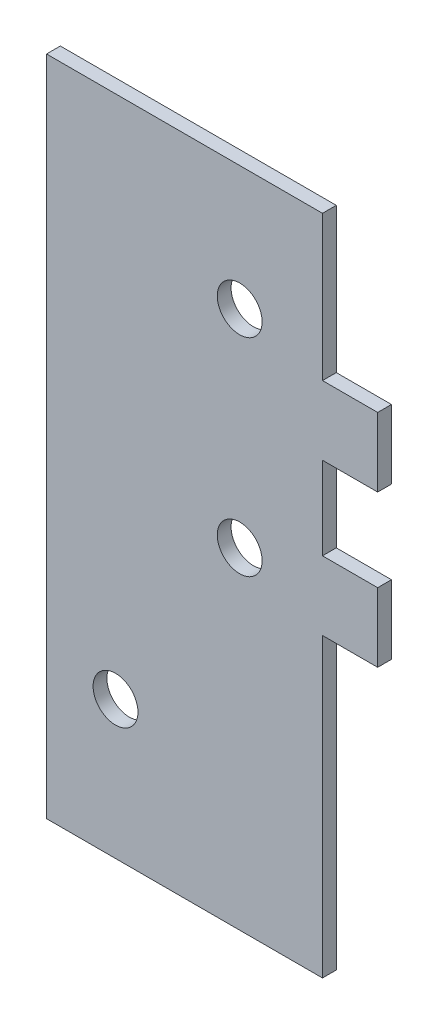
ISO-10303-21;
HEADER;
FILE_DESCRIPTION(('STEP AP214'),'2;1');
FILE_NAME('part.step','',(''),(''),'','','');
FILE_SCHEMA(('AUTOMOTIVE_DESIGN { 1 0 10303 214 1 1 1 1 }'));
ENDSEC;
DATA;
#1=APPLICATION_CONTEXT('core data for automotive mechanical design processes');
#2=APPLICATION_PROTOCOL_DEFINITION('international standard','automotive_design',2000,#1);
#3=PRODUCT_CONTEXT('',#1,'mechanical');
#4=PRODUCT('Part','Part','',(#3));
#5=PRODUCT_RELATED_PRODUCT_CATEGORY('part','',(#4));
#6=PRODUCT_DEFINITION_FORMATION('','',#4);
#7=PRODUCT_DEFINITION_CONTEXT('part definition',#1,'design');
#8=PRODUCT_DEFINITION('design','',#6,#7);
#9=PRODUCT_DEFINITION_SHAPE('','',#8);
#10=(LENGTH_UNIT() NAMED_UNIT(*) SI_UNIT(.MILLI.,.METRE.));
#11=(NAMED_UNIT(*) PLANE_ANGLE_UNIT() SI_UNIT($,.RADIAN.));
#12=(NAMED_UNIT(*) SI_UNIT($,.STERADIAN.) SOLID_ANGLE_UNIT());
#13=UNCERTAINTY_MEASURE_WITH_UNIT(LENGTH_MEASURE(1.E-05),#10,'distance_accuracy_value','');
#14=(GEOMETRIC_REPRESENTATION_CONTEXT(3) GLOBAL_UNCERTAINTY_ASSIGNED_CONTEXT((#13)) GLOBAL_UNIT_ASSIGNED_CONTEXT((#10,
#11,#12)) REPRESENTATION_CONTEXT('',''));
#15=CARTESIAN_POINT('',(0.,0.,0.));
#16=DIRECTION('',(0.,0.,1.));
#17=DIRECTION('',(1.,0.,0.));
#18=AXIS2_PLACEMENT_3D('',#15,#16,#17);
#19=CARTESIAN_POINT('',(0.,0.,6.35));
#20=DIRECTION('',(0.,0.,1.));
#21=DIRECTION('',(1.,0.,0.));
#22=AXIS2_PLACEMENT_3D('',#19,#20,#21);
#23=PLANE('',#22);
#24=CARTESIAN_POINT('',(88.9,152.4,6.35));
#25=DIRECTION('',(0.,0.,1.));
#26=DIRECTION('',(1.,0.,0.));
#27=AXIS2_PLACEMENT_3D('',#24,#25,#26);
#28=CIRCLE('',#27,10.31875);
#29=CARTESIAN_POINT('',(99.21875,152.4,6.35));
#30=VERTEX_POINT('',#29);
#31=EDGE_CURVE('E285',#30,#30,#28,.T.);
#32=ORIENTED_EDGE('',*,*,#31,.F.);
#33=EDGE_LOOP('',(#32));
#34=FACE_BOUND('',#33,.T.);
#35=DIRECTION('',(0.,-1.,0.));
#36=VECTOR('',#35,1.);
#37=CARTESIAN_POINT('',(0.,304.8,6.35));
#38=LINE('',#37,#36);
#39=CARTESIAN_POINT('',(0.,304.8,6.35));
#40=VERTEX_POINT('',#39);
#41=CARTESIAN_POINT('',(0.,0.,6.35));
#42=VERTEX_POINT('',#41);
#43=EDGE_CURVE('E176',#40,#42,#38,.T.);
#44=ORIENTED_EDGE('',*,*,#43,.T.);
#45=DIRECTION('',(1.,0.,0.));
#46=VECTOR('',#45,1.);
#47=CARTESIAN_POINT('',(0.,0.,6.35));
#48=LINE('',#47,#46);
#49=CARTESIAN_POINT('',(127.,0.,6.35));
#50=VERTEX_POINT('',#49);
#51=EDGE_CURVE('E104',#42,#50,#48,.T.);
#52=ORIENTED_EDGE('',*,*,#51,.T.);
#53=DIRECTION('',(0.,1.,0.));
#54=VECTOR('',#53,1.);
#55=CARTESIAN_POINT('',(127.,0.,6.35));
#56=LINE('',#55,#54);
#57=CARTESIAN_POINT('',(127.,136.525,6.35));
#58=VERTEX_POINT('',#57);
#59=EDGE_CURVE('E203',#50,#58,#56,.T.);
#60=ORIENTED_EDGE('',*,*,#59,.T.);
#61=DIRECTION('',(1.,0.,0.));
#62=VECTOR('',#61,1.);
#63=CARTESIAN_POINT('',(127.,136.525,6.35));
#64=LINE('',#63,#62);
#65=CARTESIAN_POINT('',(152.4,136.525,6.35));
#66=VERTEX_POINT('',#65);
#67=EDGE_CURVE('E222',#58,#66,#64,.T.);
#68=ORIENTED_EDGE('',*,*,#67,.T.);
#69=DIRECTION('',(0.,1.,0.));
#70=VECTOR('',#69,1.);
#71=CARTESIAN_POINT('',(152.4,136.525,6.35));
#72=LINE('',#71,#70);
#73=CARTESIAN_POINT('',(152.4,168.275,6.35));
#74=VERTEX_POINT('',#73);
#75=EDGE_CURVE('E219',#66,#74,#72,.T.);
#76=ORIENTED_EDGE('',*,*,#75,.T.);
#77=DIRECTION('',(-1.,0.,0.));
#78=VECTOR('',#77,1.);
#79=CARTESIAN_POINT('',(152.4,168.275,6.35));
#80=LINE('',#79,#78);
#81=CARTESIAN_POINT('',(127.,168.275,6.35));
#82=VERTEX_POINT('',#81);
#83=EDGE_CURVE('E221',#74,#82,#80,.T.);
#84=ORIENTED_EDGE('',*,*,#83,.T.);
#85=DIRECTION('',(0.,1.,0.));
#86=VECTOR('',#85,1.);
#87=CARTESIAN_POINT('',(127.,168.275,6.35));
#88=LINE('',#87,#86);
#89=CARTESIAN_POINT('',(127.,206.375,6.35));
#90=VERTEX_POINT('',#89);
#91=EDGE_CURVE('E224',#82,#90,#88,.T.);
#92=ORIENTED_EDGE('',*,*,#91,.T.);
#93=DIRECTION('',(1.,0.,0.));
#94=VECTOR('',#93,1.);
#95=CARTESIAN_POINT('',(127.,206.375,6.35));
#96=LINE('',#95,#94);
#97=CARTESIAN_POINT('',(152.4,206.375,6.35));
#98=VERTEX_POINT('',#97);
#99=EDGE_CURVE('E230',#90,#98,#96,.T.);
#100=ORIENTED_EDGE('',*,*,#99,.T.);
#101=DIRECTION('',(0.,1.,0.));
#102=VECTOR('',#101,1.);
#103=CARTESIAN_POINT('',(152.4,206.375,6.35));
#104=LINE('',#103,#102);
#105=CARTESIAN_POINT('',(152.4,238.125,6.35));
#106=VERTEX_POINT('',#105);
#107=EDGE_CURVE('E135',#98,#106,#104,.T.);
#108=ORIENTED_EDGE('',*,*,#107,.T.);
#109=DIRECTION('',(-1.,0.,0.));
#110=VECTOR('',#109,1.);
#111=CARTESIAN_POINT('',(152.4,238.125,6.35));
#112=LINE('',#111,#110);
#113=CARTESIAN_POINT('',(127.,238.125,6.35));
#114=VERTEX_POINT('',#113);
#115=EDGE_CURVE('E129',#106,#114,#112,.T.);
#116=ORIENTED_EDGE('',*,*,#115,.T.);
#117=DIRECTION('',(0.,1.,0.));
#118=VECTOR('',#117,1.);
#119=CARTESIAN_POINT('',(127.,238.125,6.35));
#120=LINE('',#119,#118);
#121=CARTESIAN_POINT('',(127.,304.8,6.35));
#122=VERTEX_POINT('',#121);
#123=EDGE_CURVE('E133',#114,#122,#120,.T.);
#124=ORIENTED_EDGE('',*,*,#123,.T.);
#125=DIRECTION('',(-1.,0.,0.));
#126=VECTOR('',#125,1.);
#127=CARTESIAN_POINT('',(127.,304.8,6.35));
#128=LINE('',#127,#126);
#129=EDGE_CURVE('E49',#122,#40,#128,.T.);
#130=ORIENTED_EDGE('',*,*,#129,.T.);
#131=EDGE_LOOP('',(#44,#52,#60,#68,#76,#84,#92,#100,#108,#116,#124,#130));
#132=FACE_BOUND('',#131,.T.);
#133=CARTESIAN_POINT('',(88.9,247.65,6.35));
#134=DIRECTION('',(0.,0.,1.));
#135=DIRECTION('',(1.,0.,0.));
#136=AXIS2_PLACEMENT_3D('',#133,#134,#135);
#137=CIRCLE('',#136,10.31875);
#138=CARTESIAN_POINT('',(99.21875,247.65,6.35));
#139=VERTEX_POINT('',#138);
#140=EDGE_CURVE('E157',#139,#139,#137,.T.);
#141=ORIENTED_EDGE('',*,*,#140,.F.);
#142=EDGE_LOOP('',(#141));
#143=FACE_BOUND('',#142,.T.);
#144=CARTESIAN_POINT('',(31.75,63.5,6.35));
#145=DIRECTION('',(0.,0.,1.));
#146=DIRECTION('',(1.,0.,0.));
#147=AXIS2_PLACEMENT_3D('',#144,#145,#146);
#148=CIRCLE('',#147,10.31875);
#149=CARTESIAN_POINT('',(42.06875,63.5,6.35));
#150=VERTEX_POINT('',#149);
#151=EDGE_CURVE('E276',#150,#150,#148,.T.);
#152=ORIENTED_EDGE('',*,*,#151,.F.);
#153=EDGE_LOOP('',(#152));
#154=FACE_BOUND('',#153,.T.);
#155=ADVANCED_FACE('F32',(#34,#132,#143,#154),#23,.T.);
#156=CARTESIAN_POINT('',(0.,0.,0.));
#157=DIRECTION('',(0.,0.,1.));
#158=DIRECTION('',(1.,0.,0.));
#159=AXIS2_PLACEMENT_3D('',#156,#157,#158);
#160=PLANE('',#159);
#161=DIRECTION('',(0.,-1.,0.));
#162=VECTOR('',#161,1.);
#163=CARTESIAN_POINT('',(0.,304.8,0.));
#164=LINE('',#163,#162);
#165=CARTESIAN_POINT('',(0.,304.8,0.));
#166=VERTEX_POINT('',#165);
#167=CARTESIAN_POINT('',(0.,0.,0.));
#168=VERTEX_POINT('',#167);
#169=EDGE_CURVE('E153',#166,#168,#164,.T.);
#170=ORIENTED_EDGE('',*,*,#169,.F.);
#171=DIRECTION('',(-1.,0.,0.));
#172=VECTOR('',#171,1.);
#173=CARTESIAN_POINT('',(127.,304.8,0.));
#174=LINE('',#173,#172);
#175=CARTESIAN_POINT('',(127.,304.8,0.));
#176=VERTEX_POINT('',#175);
#177=EDGE_CURVE('E96',#176,#166,#174,.T.);
#178=ORIENTED_EDGE('',*,*,#177,.F.);
#179=DIRECTION('',(0.,1.,0.));
#180=VECTOR('',#179,1.);
#181=CARTESIAN_POINT('',(127.,238.125,0.));
#182=LINE('',#181,#180);
#183=CARTESIAN_POINT('',(127.,238.125,0.));
#184=VERTEX_POINT('',#183);
#185=EDGE_CURVE('E90',#184,#176,#182,.T.);
#186=ORIENTED_EDGE('',*,*,#185,.F.);
#187=DIRECTION('',(-1.,0.,0.));
#188=VECTOR('',#187,1.);
#189=CARTESIAN_POINT('',(152.4,238.125,0.));
#190=LINE('',#189,#188);
#191=CARTESIAN_POINT('',(152.4,238.125,0.));
#192=VERTEX_POINT('',#191);
#193=EDGE_CURVE('E143',#192,#184,#190,.T.);
#194=ORIENTED_EDGE('',*,*,#193,.F.);
#195=DIRECTION('',(0.,1.,0.));
#196=VECTOR('',#195,1.);
#197=CARTESIAN_POINT('',(152.4,206.375,0.));
#198=LINE('',#197,#196);
#199=CARTESIAN_POINT('',(152.4,206.375,0.));
#200=VERTEX_POINT('',#199);
#201=EDGE_CURVE('E171',#200,#192,#198,.T.);
#202=ORIENTED_EDGE('',*,*,#201,.F.);
#203=DIRECTION('',(1.,0.,0.));
#204=VECTOR('',#203,1.);
#205=CARTESIAN_POINT('',(127.,206.375,0.));
#206=LINE('',#205,#204);
#207=CARTESIAN_POINT('',(127.,206.375,0.));
#208=VERTEX_POINT('',#207);
#209=EDGE_CURVE('E169',#208,#200,#206,.T.);
#210=ORIENTED_EDGE('',*,*,#209,.F.);
#211=DIRECTION('',(0.,1.,0.));
#212=VECTOR('',#211,1.);
#213=CARTESIAN_POINT('',(127.,168.275,0.));
#214=LINE('',#213,#212);
#215=CARTESIAN_POINT('',(127.,168.275,0.));
#216=VERTEX_POINT('',#215);
#217=EDGE_CURVE('E167',#216,#208,#214,.T.);
#218=ORIENTED_EDGE('',*,*,#217,.F.);
#219=DIRECTION('',(-1.,0.,0.));
#220=VECTOR('',#219,1.);
#221=CARTESIAN_POINT('',(152.4,168.275,0.));
#222=LINE('',#221,#220);
#223=CARTESIAN_POINT('',(152.4,168.275,0.));
#224=VERTEX_POINT('',#223);
#225=EDGE_CURVE('E165',#224,#216,#222,.T.);
#226=ORIENTED_EDGE('',*,*,#225,.F.);
#227=DIRECTION('',(0.,1.,0.));
#228=VECTOR('',#227,1.);
#229=CARTESIAN_POINT('',(152.4,136.525,0.));
#230=LINE('',#229,#228);
#231=CARTESIAN_POINT('',(152.4,136.525,0.));
#232=VERTEX_POINT('',#231);
#233=EDGE_CURVE('E163',#232,#224,#230,.T.);
#234=ORIENTED_EDGE('',*,*,#233,.F.);
#235=DIRECTION('',(1.,0.,0.));
#236=VECTOR('',#235,1.);
#237=CARTESIAN_POINT('',(127.,136.525,0.));
#238=LINE('',#237,#236);
#239=CARTESIAN_POINT('',(127.,136.525,0.));
#240=VERTEX_POINT('',#239);
#241=EDGE_CURVE('E161',#240,#232,#238,.T.);
#242=ORIENTED_EDGE('',*,*,#241,.F.);
#243=DIRECTION('',(0.,1.,0.));
#244=VECTOR('',#243,1.);
#245=CARTESIAN_POINT('',(127.,0.,0.));
#246=LINE('',#245,#244);
#247=CARTESIAN_POINT('',(127.,0.,0.));
#248=VERTEX_POINT('',#247);
#249=EDGE_CURVE('E159',#248,#240,#246,.T.);
#250=ORIENTED_EDGE('',*,*,#249,.F.);
#251=DIRECTION('',(1.,0.,0.));
#252=VECTOR('',#251,1.);
#253=CARTESIAN_POINT('',(0.,0.,0.));
#254=LINE('',#253,#252);
#255=EDGE_CURVE('E156',#168,#248,#254,.T.);
#256=ORIENTED_EDGE('',*,*,#255,.F.);
#257=EDGE_LOOP('',(#170,#178,#186,#194,#202,#210,#218,#226,#234,#242,#250,#256));
#258=FACE_BOUND('',#257,.T.);
#259=CARTESIAN_POINT('',(88.9,247.65,0.));
#260=DIRECTION('',(0.,0.,1.));
#261=DIRECTION('',(1.,0.,0.));
#262=AXIS2_PLACEMENT_3D('',#259,#260,#261);
#263=CIRCLE('',#262,10.31875);
#264=CARTESIAN_POINT('',(99.21875,247.65,0.));
#265=VERTEX_POINT('',#264);
#266=EDGE_CURVE('E288',#265,#265,#263,.T.);
#267=ORIENTED_EDGE('',*,*,#266,.T.);
#268=EDGE_LOOP('',(#267));
#269=FACE_BOUND('',#268,.T.);
#270=CARTESIAN_POINT('',(88.9,152.4,0.));
#271=DIRECTION('',(0.,0.,1.));
#272=DIRECTION('',(1.,0.,0.));
#273=AXIS2_PLACEMENT_3D('',#270,#271,#272);
#274=CIRCLE('',#273,10.31875);
#275=CARTESIAN_POINT('',(99.21875,152.4,0.));
#276=VERTEX_POINT('',#275);
#277=EDGE_CURVE('E282',#276,#276,#274,.T.);
#278=ORIENTED_EDGE('',*,*,#277,.T.);
#279=EDGE_LOOP('',(#278));
#280=FACE_BOUND('',#279,.T.);
#281=CARTESIAN_POINT('',(31.75,63.5,0.));
#282=DIRECTION('',(0.,0.,1.));
#283=DIRECTION('',(1.,0.,0.));
#284=AXIS2_PLACEMENT_3D('',#281,#282,#283);
#285=CIRCLE('',#284,10.31875);
#286=CARTESIAN_POINT('',(42.06875,63.5,0.));
#287=VERTEX_POINT('',#286);
#288=EDGE_CURVE('E279',#287,#287,#285,.T.);
#289=ORIENTED_EDGE('',*,*,#288,.T.);
#290=EDGE_LOOP('',(#289));
#291=FACE_BOUND('',#290,.T.);
#292=ADVANCED_FACE('F207',(#258,#269,#280,#291),#160,.F.);
#293=CARTESIAN_POINT('',(0.,304.8,6.35));
#294=DIRECTION('',(1.,0.,0.));
#295=DIRECTION('',(0.,1.,0.));
#296=AXIS2_PLACEMENT_3D('',#293,#294,#295);
#297=PLANE('',#296);
#298=ORIENTED_EDGE('',*,*,#169,.T.);
#299=DIRECTION('',(0.,0.,-1.));
#300=VECTOR('',#299,1.);
#301=CARTESIAN_POINT('',(0.,0.,6.35));
#302=LINE('',#301,#300);
#303=EDGE_CURVE('E11',#42,#168,#302,.T.);
#304=ORIENTED_EDGE('',*,*,#303,.F.);
#305=ORIENTED_EDGE('',*,*,#43,.F.);
#306=DIRECTION('',(0.,0.,-1.));
#307=VECTOR('',#306,1.);
#308=CARTESIAN_POINT('',(0.,304.8,6.35));
#309=LINE('',#308,#307);
#310=EDGE_CURVE('E149',#40,#166,#309,.T.);
#311=ORIENTED_EDGE('',*,*,#310,.T.);
#312=EDGE_LOOP('',(#298,#304,#305,#311));
#313=FACE_BOUND('',#312,.T.);
#314=ADVANCED_FACE('F34',(#313),#297,.F.);
#315=CARTESIAN_POINT('',(0.,0.,6.35));
#316=DIRECTION('',(0.,1.,0.));
#317=DIRECTION('',(0.,0.,1.));
#318=AXIS2_PLACEMENT_3D('',#315,#316,#317);
#319=PLANE('',#318);
#320=ORIENTED_EDGE('',*,*,#255,.T.);
#321=DIRECTION('',(0.,0.,-1.));
#322=VECTOR('',#321,1.);
#323=CARTESIAN_POINT('',(127.,0.,6.35));
#324=LINE('',#323,#322);
#325=EDGE_CURVE('E41',#50,#248,#324,.T.);
#326=ORIENTED_EDGE('',*,*,#325,.F.);
#327=ORIENTED_EDGE('',*,*,#51,.F.);
#328=ORIENTED_EDGE('',*,*,#303,.T.);
#329=EDGE_LOOP('',(#320,#326,#327,#328));
#330=FACE_BOUND('',#329,.T.);
#331=ADVANCED_FACE('F390',(#330),#319,.F.);
#332=CARTESIAN_POINT('',(127.,0.,6.35));
#333=DIRECTION('',(-1.,0.,0.));
#334=DIRECTION('',(0.,0.,1.));
#335=AXIS2_PLACEMENT_3D('',#332,#333,#334);
#336=PLANE('',#335);
#337=ORIENTED_EDGE('',*,*,#249,.T.);
#338=DIRECTION('',(0.,0.,-1.));
#339=VECTOR('',#338,1.);
#340=CARTESIAN_POINT('',(127.,136.525,6.35));
#341=LINE('',#340,#339);
#342=EDGE_CURVE('E195',#58,#240,#341,.T.);
#343=ORIENTED_EDGE('',*,*,#342,.F.);
#344=ORIENTED_EDGE('',*,*,#59,.F.);
#345=ORIENTED_EDGE('',*,*,#325,.T.);
#346=EDGE_LOOP('',(#337,#343,#344,#345));
#347=FACE_BOUND('',#346,.T.);
#348=ADVANCED_FACE('F201',(#347),#336,.F.);
#349=CARTESIAN_POINT('',(127.,136.525,6.35));
#350=DIRECTION('',(0.,1.,0.));
#351=DIRECTION('',(0.,0.,1.));
#352=AXIS2_PLACEMENT_3D('',#349,#350,#351);
#353=PLANE('',#352);
#354=ORIENTED_EDGE('',*,*,#241,.T.);
#355=DIRECTION('',(0.,0.,-1.));
#356=VECTOR('',#355,1.);
#357=CARTESIAN_POINT('',(152.4,136.525,6.35));
#358=LINE('',#357,#356);
#359=EDGE_CURVE('E192',#66,#232,#358,.T.);
#360=ORIENTED_EDGE('',*,*,#359,.F.);
#361=ORIENTED_EDGE('',*,*,#67,.F.);
#362=ORIENTED_EDGE('',*,*,#342,.T.);
#363=EDGE_LOOP('',(#354,#360,#361,#362));
#364=FACE_BOUND('',#363,.T.);
#365=ADVANCED_FACE('F213',(#364),#353,.F.);
#366=CARTESIAN_POINT('',(152.4,136.525,6.35));
#367=DIRECTION('',(-1.,0.,0.));
#368=DIRECTION('',(0.,0.,1.));
#369=AXIS2_PLACEMENT_3D('',#366,#367,#368);
#370=PLANE('',#369);
#371=ORIENTED_EDGE('',*,*,#233,.T.);
#372=DIRECTION('',(0.,0.,-1.));
#373=VECTOR('',#372,1.);
#374=CARTESIAN_POINT('',(152.4,168.275,6.35));
#375=LINE('',#374,#373);
#376=EDGE_CURVE('E189',#74,#224,#375,.T.);
#377=ORIENTED_EDGE('',*,*,#376,.F.);
#378=ORIENTED_EDGE('',*,*,#75,.F.);
#379=ORIENTED_EDGE('',*,*,#359,.T.);
#380=EDGE_LOOP('',(#371,#377,#378,#379));
#381=FACE_BOUND('',#380,.T.);
#382=ADVANCED_FACE('F217',(#381),#370,.F.);
#383=CARTESIAN_POINT('',(152.4,168.275,6.35));
#384=DIRECTION('',(0.,-1.,0.));
#385=DIRECTION('',(0.,0.,-1.));
#386=AXIS2_PLACEMENT_3D('',#383,#384,#385);
#387=PLANE('',#386);
#388=ORIENTED_EDGE('',*,*,#225,.T.);
#389=DIRECTION('',(0.,0.,-1.));
#390=VECTOR('',#389,1.);
#391=CARTESIAN_POINT('',(127.,168.275,6.35));
#392=LINE('',#391,#390);
#393=EDGE_CURVE('E186',#82,#216,#392,.T.);
#394=ORIENTED_EDGE('',*,*,#393,.F.);
#395=ORIENTED_EDGE('',*,*,#83,.F.);
#396=ORIENTED_EDGE('',*,*,#376,.T.);
#397=EDGE_LOOP('',(#388,#394,#395,#396));
#398=FACE_BOUND('',#397,.T.);
#399=ADVANCED_FACE('F355',(#398),#387,.F.);
#400=CARTESIAN_POINT('',(127.,168.275,6.35));
#401=DIRECTION('',(-1.,0.,0.));
#402=DIRECTION('',(0.,0.,1.));
#403=AXIS2_PLACEMENT_3D('',#400,#401,#402);
#404=PLANE('',#403);
#405=ORIENTED_EDGE('',*,*,#217,.T.);
#406=DIRECTION('',(0.,0.,-1.));
#407=VECTOR('',#406,1.);
#408=CARTESIAN_POINT('',(127.,206.375,6.35));
#409=LINE('',#408,#407);
#410=EDGE_CURVE('E183',#90,#208,#409,.T.);
#411=ORIENTED_EDGE('',*,*,#410,.F.);
#412=ORIENTED_EDGE('',*,*,#91,.F.);
#413=ORIENTED_EDGE('',*,*,#393,.T.);
#414=EDGE_LOOP('',(#405,#411,#412,#413));
#415=FACE_BOUND('',#414,.T.);
#416=ADVANCED_FACE('F346',(#415),#404,.F.);
#417=CARTESIAN_POINT('',(127.,206.375,6.35));
#418=DIRECTION('',(0.,1.,0.));
#419=DIRECTION('',(0.,0.,1.));
#420=AXIS2_PLACEMENT_3D('',#417,#418,#419);
#421=PLANE('',#420);
#422=ORIENTED_EDGE('',*,*,#209,.T.);
#423=DIRECTION('',(0.,0.,-1.));
#424=VECTOR('',#423,1.);
#425=CARTESIAN_POINT('',(152.4,206.375,6.35));
#426=LINE('',#425,#424);
#427=EDGE_CURVE('E180',#98,#200,#426,.T.);
#428=ORIENTED_EDGE('',*,*,#427,.F.);
#429=ORIENTED_EDGE('',*,*,#99,.F.);
#430=ORIENTED_EDGE('',*,*,#410,.T.);
#431=EDGE_LOOP('',(#422,#428,#429,#430));
#432=FACE_BOUND('',#431,.T.);
#433=ADVANCED_FACE('F236',(#432),#421,.F.);
#434=CARTESIAN_POINT('',(152.4,206.375,6.35));
#435=DIRECTION('',(-1.,0.,0.));
#436=DIRECTION('',(0.,0.,1.));
#437=AXIS2_PLACEMENT_3D('',#434,#435,#436);
#438=PLANE('',#437);
#439=ORIENTED_EDGE('',*,*,#201,.T.);
#440=DIRECTION('',(0.,0.,-1.));
#441=VECTOR('',#440,1.);
#442=CARTESIAN_POINT('',(152.4,238.125,6.35));
#443=LINE('',#442,#441);
#444=EDGE_CURVE('E144',#106,#192,#443,.T.);
#445=ORIENTED_EDGE('',*,*,#444,.F.);
#446=ORIENTED_EDGE('',*,*,#107,.F.);
#447=ORIENTED_EDGE('',*,*,#427,.T.);
#448=EDGE_LOOP('',(#439,#445,#446,#447));
#449=FACE_BOUND('',#448,.T.);
#450=ADVANCED_FACE('F240',(#449),#438,.F.);
#451=CARTESIAN_POINT('',(152.4,238.125,6.35));
#452=DIRECTION('',(0.,-1.,0.));
#453=DIRECTION('',(0.,0.,-1.));
#454=AXIS2_PLACEMENT_3D('',#451,#452,#453);
#455=PLANE('',#454);
#456=ORIENTED_EDGE('',*,*,#193,.T.);
#457=DIRECTION('',(0.,0.,-1.));
#458=VECTOR('',#457,1.);
#459=CARTESIAN_POINT('',(127.,238.125,6.35));
#460=LINE('',#459,#458);
#461=EDGE_CURVE('E140',#114,#184,#460,.T.);
#462=ORIENTED_EDGE('',*,*,#461,.F.);
#463=ORIENTED_EDGE('',*,*,#115,.F.);
#464=ORIENTED_EDGE('',*,*,#444,.T.);
#465=EDGE_LOOP('',(#456,#462,#463,#464));
#466=FACE_BOUND('',#465,.T.);
#467=ADVANCED_FACE('F141',(#466),#455,.F.);
#468=CARTESIAN_POINT('',(127.,238.125,6.35));
#469=DIRECTION('',(-1.,0.,0.));
#470=DIRECTION('',(0.,0.,1.));
#471=AXIS2_PLACEMENT_3D('',#468,#469,#470);
#472=PLANE('',#471);
#473=ORIENTED_EDGE('',*,*,#185,.T.);
#474=DIRECTION('',(0.,0.,-1.));
#475=VECTOR('',#474,1.);
#476=CARTESIAN_POINT('',(127.,304.8,6.35));
#477=LINE('',#476,#475);
#478=EDGE_CURVE('E145',#122,#176,#477,.T.);
#479=ORIENTED_EDGE('',*,*,#478,.F.);
#480=ORIENTED_EDGE('',*,*,#123,.F.);
#481=ORIENTED_EDGE('',*,*,#461,.T.);
#482=EDGE_LOOP('',(#473,#479,#480,#481));
#483=FACE_BOUND('',#482,.T.);
#484=ADVANCED_FACE('F147',(#483),#472,.F.);
#485=CARTESIAN_POINT('',(127.,304.8,6.35));
#486=DIRECTION('',(0.,-1.,0.));
#487=DIRECTION('',(1.,0.,0.));
#488=AXIS2_PLACEMENT_3D('',#485,#486,#487);
#489=PLANE('',#488);
#490=ORIENTED_EDGE('',*,*,#177,.T.);
#491=ORIENTED_EDGE('',*,*,#310,.F.);
#492=ORIENTED_EDGE('',*,*,#129,.F.);
#493=ORIENTED_EDGE('',*,*,#478,.T.);
#494=EDGE_LOOP('',(#490,#491,#492,#493));
#495=FACE_BOUND('',#494,.T.);
#496=ADVANCED_FACE('F244',(#495),#489,.F.);
#497=CARTESIAN_POINT('',(88.9,247.65,6.35));
#498=DIRECTION('',(0.,0.,-1.));
#499=DIRECTION('',(-1.,0.,0.));
#500=AXIS2_PLACEMENT_3D('',#497,#498,#499);
#501=CYLINDRICAL_SURFACE('',#500,10.31875);
#502=ORIENTED_EDGE('',*,*,#140,.T.);
#503=EDGE_LOOP('',(#502));
#504=FACE_BOUND('',#503,.T.);
#505=ORIENTED_EDGE('',*,*,#266,.F.);
#506=EDGE_LOOP('',(#505));
#507=FACE_BOUND('',#506,.T.);
#508=ADVANCED_FACE('F246',(#504,#507),#501,.F.);
#509=CARTESIAN_POINT('',(88.9,152.4,6.35));
#510=DIRECTION('',(0.,0.,-1.));
#511=DIRECTION('',(-1.,0.,0.));
#512=AXIS2_PLACEMENT_3D('',#509,#510,#511);
#513=CYLINDRICAL_SURFACE('',#512,10.31875);
#514=ORIENTED_EDGE('',*,*,#31,.T.);
#515=EDGE_LOOP('',(#514));
#516=FACE_BOUND('',#515,.T.);
#517=ORIENTED_EDGE('',*,*,#277,.F.);
#518=EDGE_LOOP('',(#517));
#519=FACE_BOUND('',#518,.T.);
#520=ADVANCED_FACE('F252',(#516,#519),#513,.F.);
#521=CARTESIAN_POINT('',(31.75,63.5,6.35));
#522=DIRECTION('',(0.,0.,-1.));
#523=DIRECTION('',(-1.,0.,0.));
#524=AXIS2_PLACEMENT_3D('',#521,#522,#523);
#525=CYLINDRICAL_SURFACE('',#524,10.31875);
#526=ORIENTED_EDGE('',*,*,#151,.T.);
#527=EDGE_LOOP('',(#526));
#528=FACE_BOUND('',#527,.T.);
#529=ORIENTED_EDGE('',*,*,#288,.F.);
#530=EDGE_LOOP('',(#529));
#531=FACE_BOUND('',#530,.T.);
#532=ADVANCED_FACE('F267',(#528,#531),#525,.F.);
#533=CLOSED_SHELL('',(#155,#292,#314,#331,#348,#365,#382,#399,#416,#433,#450,#467,#484,#496,
#508,#520,#532));
#534=MANIFOLD_SOLID_BREP('B2',#533);
#535=ADVANCED_BREP_SHAPE_REPRESENTATION('',(#18,#534),#14);
#536=SHAPE_DEFINITION_REPRESENTATION(#9,#535);
ENDSEC;
END-ISO-10303-21;
